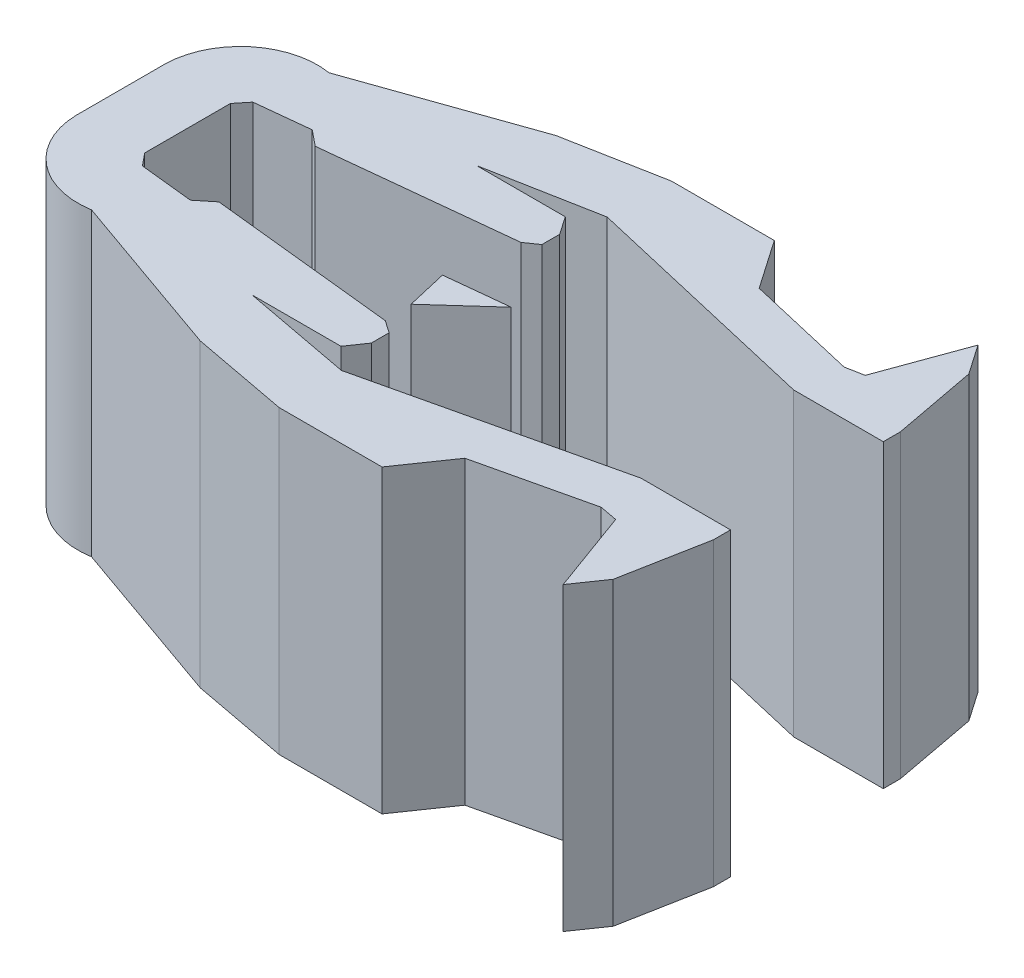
from build123d import *

# Parameters (mm, degrees)
BOSS_EXTRUDE1_DEPTH = 7.5
BOSS_EXTRUDE2_START = 1.5
BOSS_EXTRUDE2_DEPTH = 4.5


with BuildPart() as part:
    # Sketch1 → Boss-Extrude1 (new body)
    with BuildSketch(Plane(origin=(0, 0, 0), x_dir=(1, 0, 0), z_dir=(0, 1, 0))):
        with BuildLine():
            Line((0, -1.120598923), (0, 1.120598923))
            ThreePointArc((0, 1.120598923), (0.69845607, 2.551055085), (2.236008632, 2.963338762))
            Line((2.236008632, 2.963338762), (6.422744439, 4.438018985))
            Line((6.422744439, 4.438018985), (8.85017707, 4.895361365))
            Line((8.85017707, 4.895361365), (11.418330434, 4.895361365))
            Line((11.418330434, 4.895361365), (12.262654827, 3.672850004))
            Line((12.262654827, 3.672850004), (15.024299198, 3.030811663))
            Line((15.024299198, 3.030811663), (15.468179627, 3.114441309))
            Line((15.468179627, 3.114441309), (16.220425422, 5.17680283))
            Line((16.220425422, 5.17680283), (16.730664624, 4.438018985))
            Line((16.730664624, 4.438018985), (17.127286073, 2.33287437))
            Line((17.127286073, 2.33287437), (17.127286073, 1.906174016))
            Line((17.127286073, 1.906174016), (16.60825895, 1.906174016))
            Line((16.60825895, 1.906174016), (14.891201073, 1.906174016))
            Line((14.891201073, 1.906174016), (8.825282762, 3.316403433))
            Line((8.825282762, 3.316403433), (6.079036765, 2.798994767))
            Line((6.079036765, 2.798994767), (8.296877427, 2.798994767))
            Line((8.296877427, 2.798994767), (8.605874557, 2.351592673))
            Line((8.605874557, 2.351592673), (8.605874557, 1.906174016))
            Line((8.605874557, 1.906174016), (8.296877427, 1.692765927))
            Line((8.296877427, 1.692765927), (3.653093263, 1.202570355))
            Line((3.653093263, 1.202570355), (3.260320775, 1.520338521))
            Line((3.260320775, 1.520338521), (1.919940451, 1.378848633))
            Line((1.919940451, 1.378848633), (1.669169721, 1.068887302))
            Line((1.669169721, 1.068887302), (1.669169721, -1.068887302))
            Line((1.669169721, -1.068887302), (1.919940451, -1.378848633))
            Line((1.919940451, -1.378848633), (3.260320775, -1.520338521))
            Line((3.260320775, -1.520338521), (3.653093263, -1.202570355))
            Line((3.653093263, -1.202570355), (8.296877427, -1.692765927))
            Line((8.296877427, -1.692765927), (8.605874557, -1.906174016))
            Line((8.605874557, -1.906174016), (8.605874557, -2.351592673))
            Line((8.605874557, -2.351592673), (8.296877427, -2.798994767))
            Line((8.296877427, -2.798994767), (6.079036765, -2.798994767))
            Line((6.079036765, -2.798994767), (8.825282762, -3.316403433))
            Line((8.825282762, -3.316403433), (14.891201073, -1.906174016))
            Line((14.891201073, -1.906174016), (16.60825895, -1.906174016))
            Line((16.60825895, -1.906174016), (17.127286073, -1.906174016))
            Line((17.127286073, -1.906174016), (17.127286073, -2.33287437))
            Line((17.127286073, -2.33287437), (16.730664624, -4.438018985))
            Line((16.730664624, -4.438018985), (16.220425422, -5.17680283))
            Line((16.220425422, -5.17680283), (15.468179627, -3.114441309))
            Line((15.468179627, -3.114441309), (15.024299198, -3.030811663))
            Line((15.024299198, -3.030811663), (12.262654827, -3.672850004))
            Line((12.262654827, -3.672850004), (11.418330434, -4.895361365))
            Line((11.418330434, -4.895361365), (8.85017707, -4.895361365))
            Line((8.85017707, -4.895361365), (6.422744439, -4.438018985))
            Line((6.422744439, -4.438018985), (2.236008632, -2.963338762))
            ThreePointArc((2.236008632, -2.963338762), (0.69845607, -2.551055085), (0, -1.120598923))
        make_face()
    extrude(amount=BOSS_EXTRUDE1_DEPTH)

    # Sketch2 → Boss-Extrude2 (add)
    with BuildSketch(Plane(origin=(0, 0, 0), x_dir=(1, 0, 0), z_dir=(0, 1, 0)).offset(BOSS_EXTRUDE2_START)):
        Polygon((6.525604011, 1.505791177), (6.762292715, 0.485448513), (8.076529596, 1.669506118), align=None)
        Polygon((8.076529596, -1.669506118), (6.525604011, -1.505791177), (6.762292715, -0.485448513), align=None)
    extrude(amount=BOSS_EXTRUDE2_DEPTH)


solid = part.part
